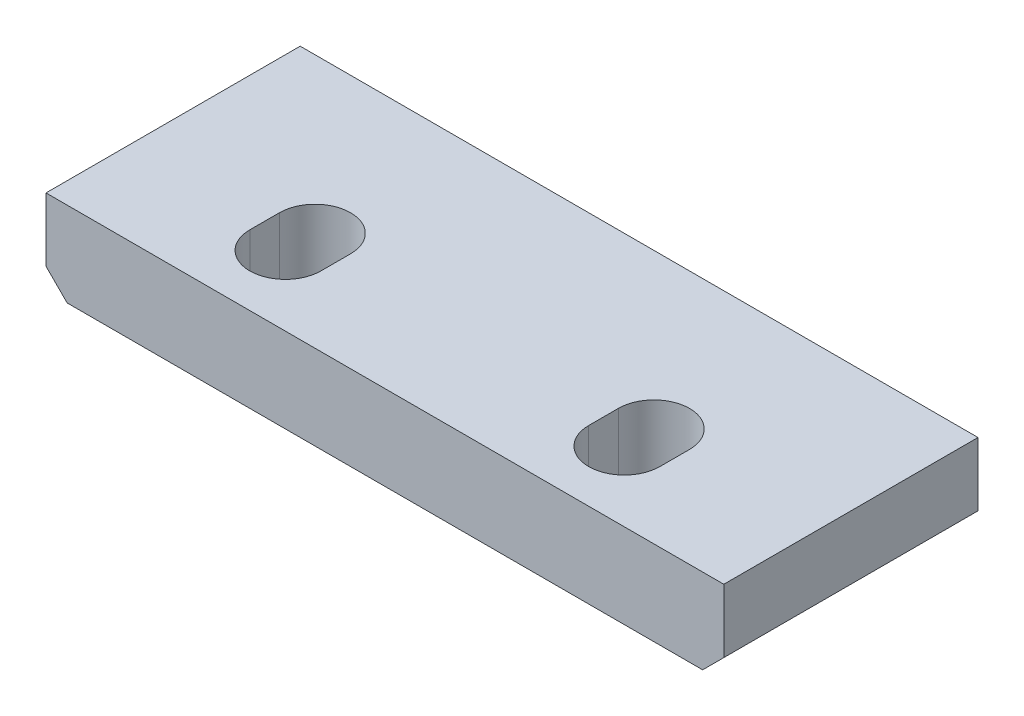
from build123d import *

# Parameters (mm, degrees)
SKETCH1_W           = 50.8
SKETCH1_H           = 19.05
SKETCH1_R           = 2.667
BOSS_EXTRUDE1_DEPTH = 6.35
CHAMFER1_SIZE       = 1.5875
CUT_EXTRUDE1_DEPTH  = 28.86051193


with BuildPart() as part:
    # Sketch1 → Boss-Extrude1 (new body)
    with BuildSketch(Plane(origin=(0, 0, 0), x_dir=(1, 0, 0), z_dir=(0, 1, 0))):
        Rectangle(SKETCH1_W, SKETCH1_H)
        with Locations(Location((-12.7, -3.175, 0), (0, 0, 270))):
            Circle(SKETCH1_R, mode=Mode.SUBTRACT)
        with Locations(Location((12.7, -3.175, 0), (0, 0, 270))):
            Circle(SKETCH1_R, mode=Mode.SUBTRACT)
    extrude(amount=BOSS_EXTRUDE1_DEPTH)

    # Chamfer1
    chamfer1_edges = [part.edges().sort_by_distance(p)[0] for p in [
        (25.4, 0, 0),
        (-25.4, 0, 0),
    ]]
    chamfer(chamfer1_edges, length=CHAMFER1_SIZE)

    # Sketch2 → Cut-Extrude1 (cut, through all)
    with BuildSketch(Plane.XZ):
        with BuildLine():
            Line((-10.033, 4.286106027), (-10.033, 2.063893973))
            ThreePointArc((-10.033, 2.063893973), (-12.7, -0.603106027), (-15.367, 2.063893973))
            Line((-15.367, 2.063893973), (-15.367, 4.286106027))
            ThreePointArc((-15.367, 4.286106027), (-12.7, 6.953106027), (-10.033, 4.286106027))
        make_face()
    cut_extrude1 = extrude(amount=-CUT_EXTRUDE1_DEPTH, mode=Mode.SUBTRACT)

    # Mirror1: Cut-Extrude1 across plane
    add(cut_extrude1.mirror(Plane(origin=(0, 0, 0), x_dir=(0, 0, 1), z_dir=(1, 0, 0))), mode=Mode.SUBTRACT)


solid = part.part
